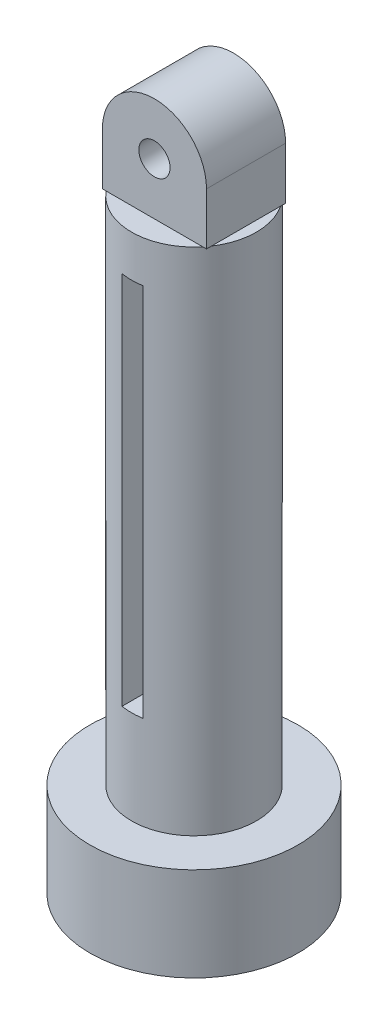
from build123d import *
from build123d.topology import SkipClean

# Parameters (mm, degrees)
SKETCH_1_W               = 10
SKETCH_1_H               = 10
EXTRUDE_1_DEPTH          = 8
SKETCH_2_R               = 1.5
CUT_EXTRUDE_1_DEPTH      = 37.28474689
SKETCH_3_R               = 6
EXTRUDE_2_DEPTH          = 53
SKETCH_4_R               = 3.25
CUT_EXTRUDE_2_DEPTH      = 49
CUT_EXTRUDE_3_DEPTH      = 15
CUT_EXTRUDE_3_DEPTH_BACK = 29
EXTRUDE_START            = -4
SKETCH_4_3_R             = 10
SKETCH_4_3_R_2           = 6
EXTRUDE_3_DEPTH          = 4
SKETCH_6_R               = 10
SKETCH_6_R_2             = 8
EXTRUDE_4_DEPTH          = 5
CUT_EXTRUDE_4_DEPTH      = 0.2
CUT_EXTRUDE_START        = -0.2
CUT_EXTRUDE_5_DEPTH      = 0.2
EXTRUDE_5_DEPTH          = 8


with BuildPart() as part:
    # Sketch 1 → Extrude 1 (new body)
    with BuildSketch(Plane.XY):
        with Locations((-18.383084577, 21.567164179)):
            Rectangle(SKETCH_1_W, SKETCH_1_H)
    extrude(amount=EXTRUDE_1_DEPTH)

    # Sketch 2 → Cut-Extrude 1 (cut, through all)
    with BuildSketch(Plane.XY.offset(8)):
        with BuildLine():
            Line((-18.383084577, 26.567164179), (-23.383084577, 26.567164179))
            Line((-23.383084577, 26.567164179), (-23.383084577, 21.567164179))
            ThreePointArc((-23.383084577, 21.567164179), (-21.918618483, 25.102698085), (-18.383084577, 26.567164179))
        make_face()
        with BuildLine():
            Line((-13.383084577, 26.567164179), (-18.383084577, 26.567164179))
            ThreePointArc((-18.383084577, 26.567164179), (-14.847550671, 25.102698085), (-13.383084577, 21.567164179))
            Line((-13.383084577, 21.567164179), (-13.383084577, 26.567164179))
        make_face()
        with Locations((-18.383084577, 21.567164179)):
            Circle(SKETCH_2_R)
    extrude(amount=-CUT_EXTRUDE_1_DEPTH, mode=Mode.SUBTRACT)

    # Sketch 3 → Extrude 2 (add)
    with BuildSketch(Plane.XZ.offset(-16.567164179)):
        with Locations(Location((-18.383084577, 4, 0), (0, 0, 41.810314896))):
            Circle(SKETCH_3_R)
    extrude(amount=EXTRUDE_2_DEPTH)

    # Sketch 4 → Cut-Extrude 2 (cut)
    with BuildSketch(Plane.XZ.offset(36.432835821)):
        with Locations(Location((-18.383084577, 4, 0), (0, 0, 270))):
            Circle(SKETCH_4_R)
    extrude(amount=-CUT_EXTRUDE_2_DEPTH, mode=Mode.SUBTRACT)

    # Sketch 5 → Cut-Extrude 3 (cut, two sides: drawn at the far end of the back side and taken through both)
    with BuildSketch(Plane(origin=(0, -16.432835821, 0), x_dir=(-1, 0, 0), z_dir=(0, -1, 0)).offset(-CUT_EXTRUDE_3_DEPTH_BACK)):
        with BuildLine():
            Line((18.383084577, -0.75), (18.383084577, 2))
            ThreePointArc((18.383084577, 2), (17.881327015, 1.978983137), (17.383084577, 1.916079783))
            Line((17.383084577, 1.916079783), (17.383084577, -0.907670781))
            ThreePointArc((17.383084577, -0.907670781), (17.876907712, -0.789659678), (18.383084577, -0.75))
        make_face()
        with BuildLine():
            Line((18.383084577, -10), (18.383084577, -7.25))
            ThreePointArc((18.383084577, -7.25), (17.876907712, -7.210340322), (17.383084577, -7.092329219))
            Line((17.383084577, -7.092329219), (17.383084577, -9.916079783))
            ThreePointArc((17.383084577, -9.916079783), (17.881327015, -9.978983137), (18.383084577, -10))
        make_face()
        with BuildLine():
            ThreePointArc((19.383084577, 1.916079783), (18.884842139, 1.978983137), (18.383084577, 2))
            Line((18.383084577, 2), (18.383084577, -0.75))
            ThreePointArc((18.383084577, -0.75), (18.889261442, -0.789659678), (19.383084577, -0.907670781))
            Line((19.383084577, -0.907670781), (19.383084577, 1.916079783))
        make_face()
        with BuildLine():
            ThreePointArc((19.383084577, -7.092329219), (18.889261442, -7.210340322), (18.383084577, -7.25))
            Line((18.383084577, -7.25), (18.383084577, -10))
            ThreePointArc((18.383084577, -10), (18.884842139, -9.978983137), (19.383084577, -9.916079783))
            Line((19.383084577, -9.916079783), (19.383084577, -7.092329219))
        make_face()
        with BuildLine():
            ThreePointArc((19.383084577, 1.916079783), (18.884842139, 1.978983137), (18.383084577, 2))
            Line((18.383084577, 2), (18.383084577, -0.75))
            ThreePointArc((18.383084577, -0.75), (18.889261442, -0.789659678), (19.383084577, -0.907670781))
            Line((19.383084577, -0.907670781), (19.383084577, 1.916079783))
        make_face()
        with BuildLine():
            ThreePointArc((19.383084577, -7.092329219), (18.889261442, -7.210340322), (18.383084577, -7.25))
            Line((18.383084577, -7.25), (18.383084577, -10))
            ThreePointArc((18.383084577, -10), (18.884842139, -9.978983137), (19.383084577, -9.916079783))
            Line((19.383084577, -9.916079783), (19.383084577, -7.092329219))
        make_face()
        with BuildLine():
            Line((18.383084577, -0.75), (18.383084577, 2))
            ThreePointArc((18.383084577, 2), (17.881327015, 1.978983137), (17.383084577, 1.916079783))
            Line((17.383084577, 1.916079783), (17.383084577, -0.907670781))
            ThreePointArc((17.383084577, -0.907670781), (17.876907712, -0.789659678), (18.383084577, -0.75))
        make_face()
        with BuildLine():
            Line((18.383084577, -10), (18.383084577, -7.25))
            ThreePointArc((18.383084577, -7.25), (17.876907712, -7.210340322), (17.383084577, -7.092329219))
            Line((17.383084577, -7.092329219), (17.383084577, -9.916079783))
            ThreePointArc((17.383084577, -9.916079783), (17.881327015, -9.978983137), (18.383084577, -10))
        make_face()
    extrude(amount=CUT_EXTRUDE_3_DEPTH + CUT_EXTRUDE_3_DEPTH_BACK, mode=Mode.SUBTRACT)

    # Sketch 4_3 → Extrude 3 (add)
    with BuildSketch(Plane.XZ.offset(36.432835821).offset(EXTRUDE_START)):
        with Locations(Location((-18.383084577, 4, 0), (0, 0, 270))):
            Circle(SKETCH_4_3_R)
        with Locations(Location((-18.383084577, 4, 0), (0, 0, 41.810314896))):
            Circle(SKETCH_4_3_R_2, mode=Mode.SUBTRACT)
    extrude(amount=EXTRUDE_3_DEPTH)

    # Sketch 6 → Extrude 4 (add)
    with BuildSketch(Plane.XZ.offset(36.432835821)):
        with Locations(Location((-18.383084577, 4, 0), (0, 0, 270))):
            Circle(SKETCH_6_R)
        with Locations(Location((-18.383084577, 4, 0), (0, 0, 270))):
            Circle(SKETCH_6_R_2, mode=Mode.SUBTRACT)
    extrude(amount=EXTRUDE_4_DEPTH)

    # Sketch 9 → Cut-Extrude 4 (cut)
    with BuildSketch(Plane.XY.offset(8)):
        with BuildLine():
            Line((-13.383084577, 16.567164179), (-13.383084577, 21.567164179))
            ThreePointArc((-13.383084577, 21.567164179), (-18.383084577, 26.567164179), (-23.383084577, 21.567164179))
            Line((-23.383084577, 21.567164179), (-23.383084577, 16.567164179))
            Line((-23.383084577, 16.567164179), (-22.855220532, 16.567164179))
            Line((-22.855220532, 16.567164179), (-13.910948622, 16.567164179))
            Line((-13.910948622, 16.567164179), (-13.383084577, 16.567164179))
        make_face()
    extrude(amount=-CUT_EXTRUDE_4_DEPTH, mode=Mode.SUBTRACT)

    # Sketch 11 → Cut-Extrude 5 (cut)
    with BuildSketch(Plane(origin=(0, 0, 0), x_dir=(-1, 0, 0), z_dir=(0, 0, -1)).offset(CUT_EXTRUDE_START)):
        with BuildLine():
            Line((13.383084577, 21.567164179), (13.383084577, 16.567164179))
            Line((13.383084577, 16.567164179), (13.910948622, 16.567164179))
            Line((13.910948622, 16.567164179), (22.855220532, 16.567164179))
            Line((22.855220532, 16.567164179), (23.383084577, 16.567164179))
            Line((23.383084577, 16.567164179), (23.383084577, 21.567164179))
            ThreePointArc((23.383084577, 21.567164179), (18.383084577, 26.567164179), (13.383084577, 21.567164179))
        make_face()
    extrude(amount=CUT_EXTRUDE_5_DEPTH, mode=Mode.SUBTRACT)

    # Sketch 12 → Extrude 5 (add)
    with SkipClean():  # the faces are left unmerged after this step: merging them gives an invalid solid
        with BuildSketch(Plane(origin=(0, -31.432835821, 0), x_dir=(1, 0, 0), z_dir=(0, 1, 0))):
            with BuildLine():
                Line((-19.383084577, -7.092329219), (-19.383084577, -9.916079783))
                ThreePointArc((-19.383084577, -9.916079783), (-18.383084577, -10), (-17.383084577, -9.916079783))
                Line((-17.383084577, -9.916079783), (-17.383084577, -7.092329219))
                ThreePointArc((-17.383084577, -7.092329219), (-18.383084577, -7.25), (-19.383084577, -7.092329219))
            make_face()
            with BuildLine():
                Line((-17.383084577, -0.907670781), (-17.383084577, 1.916079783))
                ThreePointArc((-17.383084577, 1.916079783), (-18.383084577, 2), (-19.383084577, 1.916079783))
                Line((-19.383084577, 1.916079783), (-19.383084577, -0.907670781))
                ThreePointArc((-19.383084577, -0.907670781), (-18.383084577, -0.75), (-17.383084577, -0.907670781))
            make_face()
        extrude(amount=EXTRUDE_5_DEPTH)


solid = part.part
